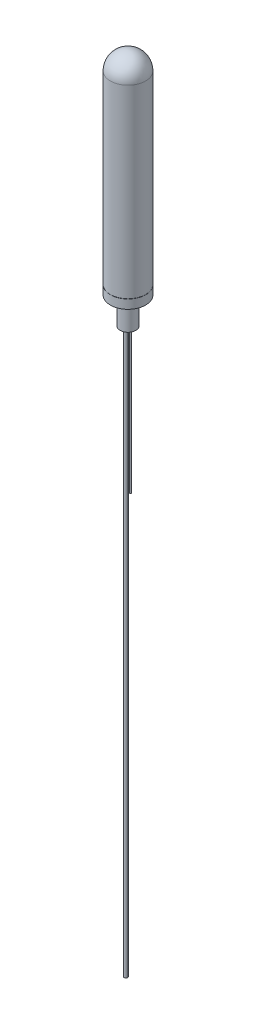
ISO-10303-21;
HEADER;
FILE_DESCRIPTION(('STEP AP214'),'2;1');
FILE_NAME('part.step','',(''),(''),'','','');
FILE_SCHEMA(('AUTOMOTIVE_DESIGN { 1 0 10303 214 1 1 1 1 }'));
ENDSEC;
DATA;
#1=APPLICATION_CONTEXT('core data for automotive mechanical design processes');
#2=APPLICATION_PROTOCOL_DEFINITION('international standard','automotive_design',2000,#1);
#3=PRODUCT_CONTEXT('',#1,'mechanical');
#4=PRODUCT('Part','Part','',(#3));
#5=PRODUCT_RELATED_PRODUCT_CATEGORY('part','',(#4));
#6=PRODUCT_DEFINITION_FORMATION('','',#4);
#7=PRODUCT_DEFINITION_CONTEXT('part definition',#1,'design');
#8=PRODUCT_DEFINITION('design','',#6,#7);
#9=PRODUCT_DEFINITION_SHAPE('','',#8);
#10=(LENGTH_UNIT() NAMED_UNIT(*) SI_UNIT(.MILLI.,.METRE.));
#11=(NAMED_UNIT(*) PLANE_ANGLE_UNIT() SI_UNIT($,.RADIAN.));
#12=(NAMED_UNIT(*) SI_UNIT($,.STERADIAN.) SOLID_ANGLE_UNIT());
#13=UNCERTAINTY_MEASURE_WITH_UNIT(LENGTH_MEASURE(1.E-05),#10,'distance_accuracy_value','');
#14=(GEOMETRIC_REPRESENTATION_CONTEXT(3) GLOBAL_UNCERTAINTY_ASSIGNED_CONTEXT((#13)) GLOBAL_UNIT_ASSIGNED_CONTEXT((#10,
#11,#12)) REPRESENTATION_CONTEXT('',''));
#15=CARTESIAN_POINT('',(0.,0.,0.));
#16=DIRECTION('',(0.,0.,1.));
#17=DIRECTION('',(1.,0.,0.));
#18=AXIS2_PLACEMENT_3D('',#15,#16,#17);
#19=CARTESIAN_POINT('',(1.778,-120.6,0.));
#20=DIRECTION('',(0.,1.,0.));
#21=DIRECTION('',(0.,0.,1.));
#22=AXIS2_PLACEMENT_3D('',#19,#20,#21);
#23=CYLINDRICAL_SURFACE('',#22,0.5969);
#24=CARTESIAN_POINT('',(1.778,-120.6,0.));
#25=DIRECTION('',(0.,-1.,0.));
#26=DIRECTION('',(0.,0.,-1.));
#27=AXIS2_PLACEMENT_3D('',#24,#25,#26);
#28=CIRCLE('',#27,0.5969);
#29=CARTESIAN_POINT('',(1.778,-120.6,-0.5969));
#30=VERTEX_POINT('',#29);
#31=EDGE_CURVE('E11',#30,#30,#28,.T.);
#32=ORIENTED_EDGE('',*,*,#31,.F.);
#33=EDGE_LOOP('',(#32));
#34=FACE_BOUND('',#33,.T.);
#35=CARTESIAN_POINT('',(1.778,-19.,0.));
#36=DIRECTION('',(0.,-1.,0.));
#37=DIRECTION('',(0.,0.,-1.));
#38=AXIS2_PLACEMENT_3D('',#35,#36,#37);
#39=CIRCLE('',#38,0.5969);
#40=CARTESIAN_POINT('',(1.778,-19.,-0.5969));
#41=VERTEX_POINT('',#40);
#42=EDGE_CURVE('E52',#41,#41,#39,.T.);
#43=ORIENTED_EDGE('',*,*,#42,.T.);
#44=EDGE_LOOP('',(#43));
#45=FACE_BOUND('',#44,.T.);
#46=ADVANCED_FACE('F49',(#34,#45),#23,.T.);
#47=CARTESIAN_POINT('',(1.778,-120.6,0.));
#48=DIRECTION('',(0.,-1.,0.));
#49=DIRECTION('',(0.,0.,-1.));
#50=AXIS2_PLACEMENT_3D('',#47,#48,#49);
#51=PLANE('',#50);
#52=ORIENTED_EDGE('',*,*,#31,.T.);
#53=EDGE_LOOP('',(#52));
#54=FACE_BOUND('',#53,.T.);
#55=ADVANCED_FACE('F66',(#54),#51,.T.);
#56=CARTESIAN_POINT('',(1.778,-19.,0.));
#57=DIRECTION('',(0.,-1.,0.));
#58=DIRECTION('',(0.,0.,-1.));
#59=AXIS2_PLACEMENT_3D('',#56,#57,#58);
#60=PLANE('',#59);
#61=ORIENTED_EDGE('',*,*,#42,.F.);
#62=EDGE_LOOP('',(#61));
#63=FACE_BOUND('',#62,.T.);
#64=ADVANCED_FACE('F64',(#63),#60,.F.);
#65=CLOSED_SHELL('',(#46,#55,#64));
#66=MANIFOLD_SOLID_BREP('B2',#65);
#67=CARTESIAN_POINT('',(-1.524,-419.,0.));
#68=DIRECTION('',(0.,1.,0.));
#69=DIRECTION('',(0.,0.,1.));
#70=AXIS2_PLACEMENT_3D('',#67,#68,#69);
#71=CYLINDRICAL_SURFACE('',#70,1.2446);
#72=CARTESIAN_POINT('',(-1.524,-419.,0.));
#73=DIRECTION('',(0.,-1.,0.));
#74=DIRECTION('',(0.,0.,-1.));
#75=AXIS2_PLACEMENT_3D('',#72,#73,#74);
#76=CIRCLE('',#75,1.2446);
#77=CARTESIAN_POINT('',(-1.524,-419.,-1.2446));
#78=VERTEX_POINT('',#77);
#79=EDGE_CURVE('E48',#78,#78,#76,.T.);
#80=ORIENTED_EDGE('',*,*,#79,.F.);
#81=EDGE_LOOP('',(#80));
#82=FACE_BOUND('',#81,.T.);
#83=CARTESIAN_POINT('',(-1.524,-19.,0.));
#84=DIRECTION('',(0.,-1.,0.));
#85=DIRECTION('',(0.,0.,-1.));
#86=AXIS2_PLACEMENT_3D('',#83,#84,#85);
#87=CIRCLE('',#86,1.2446);
#88=CARTESIAN_POINT('',(-1.524,-19.,-1.2446));
#89=VERTEX_POINT('',#88);
#90=EDGE_CURVE('E102',#89,#89,#87,.T.);
#91=ORIENTED_EDGE('',*,*,#90,.T.);
#92=EDGE_LOOP('',(#91));
#93=FACE_BOUND('',#92,.T.);
#94=ADVANCED_FACE('F99',(#82,#93),#71,.T.);
#95=CARTESIAN_POINT('',(-1.524,-419.,0.));
#96=DIRECTION('',(0.,-1.,0.));
#97=DIRECTION('',(0.,0.,-1.));
#98=AXIS2_PLACEMENT_3D('',#95,#96,#97);
#99=PLANE('',#98);
#100=ORIENTED_EDGE('',*,*,#79,.T.);
#101=EDGE_LOOP('',(#100));
#102=FACE_BOUND('',#101,.T.);
#103=ADVANCED_FACE('F115',(#102),#99,.T.);
#104=CARTESIAN_POINT('',(-1.524,-19.,0.));
#105=DIRECTION('',(0.,-1.,0.));
#106=DIRECTION('',(0.,0.,-1.));
#107=AXIS2_PLACEMENT_3D('',#104,#105,#106);
#108=PLANE('',#107);
#109=ORIENTED_EDGE('',*,*,#90,.F.);
#110=EDGE_LOOP('',(#109));
#111=FACE_BOUND('',#110,.T.);
#112=ADVANCED_FACE('F113',(#111),#108,.F.);
#113=CLOSED_SHELL('',(#94,#103,#112));
#114=MANIFOLD_SOLID_BREP('B6',#113);
#115=CARTESIAN_POINT('',(-3.01625,0.,0.));
#116=DIRECTION('',(0.,1.,0.));
#117=DIRECTION('',(0.,0.,1.));
#118=AXIS2_PLACEMENT_3D('',#115,#116,#117);
#119=PLANE('',#118);
#120=CARTESIAN_POINT('',(0.,0.,0.));
#121=DIRECTION('',(0.,-1.,0.));
#122=DIRECTION('',(0.,0.,-1.));
#123=AXIS2_PLACEMENT_3D('',#120,#121,#122);
#124=CIRCLE('',#123,3.01625);
#125=CARTESIAN_POINT('',(0.,0.,-3.01625));
#126=VERTEX_POINT('',#125);
#127=EDGE_CURVE('E98',#126,#126,#124,.T.);
#128=ORIENTED_EDGE('',*,*,#127,.T.);
#129=EDGE_LOOP('',(#128));
#130=FACE_BOUND('',#129,.T.);
#131=ADVANCED_FACE('F142',(#130),#119,.F.);
#132=CARTESIAN_POINT('',(0.,0.,0.));
#133=DIRECTION('',(0.,-1.,0.));
#134=DIRECTION('',(0.,0.,-1.));
#135=AXIS2_PLACEMENT_3D('',#132,#133,#134);
#136=CYLINDRICAL_SURFACE('',#135,3.01625);
#137=ORIENTED_EDGE('',*,*,#127,.F.);
#138=EDGE_LOOP('',(#137));
#139=FACE_BOUND('',#138,.T.);
#140=CARTESIAN_POINT('',(0.,-19.,0.));
#141=DIRECTION('',(0.,-1.,0.));
#142=DIRECTION('',(0.,0.,-1.));
#143=AXIS2_PLACEMENT_3D('',#140,#141,#142);
#144=CIRCLE('',#143,3.01625);
#145=CARTESIAN_POINT('',(0.,-19.,-3.01625));
#146=VERTEX_POINT('',#145);
#147=EDGE_CURVE('E149',#146,#146,#144,.T.);
#148=ORIENTED_EDGE('',*,*,#147,.T.);
#149=EDGE_LOOP('',(#148));
#150=FACE_BOUND('',#149,.T.);
#151=ADVANCED_FACE('F202',(#139,#150),#136,.F.);
#152=CARTESIAN_POINT('',(-3.01625,-19.,0.));
#153=DIRECTION('',(0.,1.,0.));
#154=DIRECTION('',(0.,0.,1.));
#155=AXIS2_PLACEMENT_3D('',#152,#153,#154);
#156=PLANE('',#155);
#157=ORIENTED_EDGE('',*,*,#147,.F.);
#158=EDGE_LOOP('',(#157));
#159=FACE_BOUND('',#158,.T.);
#160=CARTESIAN_POINT('',(0.,-19.,0.));
#161=DIRECTION('',(0.,-1.,0.));
#162=DIRECTION('',(0.,0.,-1.));
#163=AXIS2_PLACEMENT_3D('',#160,#161,#162);
#164=CIRCLE('',#163,5.55625);
#165=CARTESIAN_POINT('',(0.,-19.,-5.55625));
#166=VERTEX_POINT('',#165);
#167=EDGE_CURVE('E156',#166,#166,#164,.T.);
#168=ORIENTED_EDGE('',*,*,#167,.T.);
#169=EDGE_LOOP('',(#168));
#170=FACE_BOUND('',#169,.T.);
#171=ADVANCED_FACE('F206',(#159,#170),#156,.F.);
#172=CARTESIAN_POINT('',(0.,0.,0.));
#173=DIRECTION('',(0.,-1.,0.));
#174=DIRECTION('',(0.,0.,-1.));
#175=AXIS2_PLACEMENT_3D('',#172,#173,#174);
#176=CYLINDRICAL_SURFACE('',#175,5.55625);
#177=ORIENTED_EDGE('',*,*,#167,.F.);
#178=EDGE_LOOP('',(#177));
#179=FACE_BOUND('',#178,.T.);
#180=CARTESIAN_POINT('',(0.,0.,0.));
#181=DIRECTION('',(0.,-1.,0.));
#182=DIRECTION('',(0.,0.,-1.));
#183=AXIS2_PLACEMENT_3D('',#180,#181,#182);
#184=CIRCLE('',#183,5.55625);
#185=CARTESIAN_POINT('',(0.,0.,-5.55625));
#186=VERTEX_POINT('',#185);
#187=EDGE_CURVE('E161',#186,#186,#184,.T.);
#188=ORIENTED_EDGE('',*,*,#187,.T.);
#189=EDGE_LOOP('',(#188));
#190=FACE_BOUND('',#189,.T.);
#191=ADVANCED_FACE('F211',(#179,#190),#176,.T.);
#192=CARTESIAN_POINT('',(-5.55625,0.,0.));
#193=DIRECTION('',(0.,1.,0.));
#194=DIRECTION('',(0.,0.,1.));
#195=AXIS2_PLACEMENT_3D('',#192,#193,#194);
#196=PLANE('',#195);
#197=ORIENTED_EDGE('',*,*,#187,.F.);
#198=EDGE_LOOP('',(#197));
#199=FACE_BOUND('',#198,.T.);
#200=CARTESIAN_POINT('',(0.,0.,0.));
#201=DIRECTION('',(0.,-1.,0.));
#202=DIRECTION('',(0.,0.,-1.));
#203=AXIS2_PLACEMENT_3D('',#200,#201,#202);
#204=CIRCLE('',#203,12.5);
#205=CARTESIAN_POINT('',(0.,0.,-12.5));
#206=VERTEX_POINT('',#205);
#207=EDGE_CURVE('E166',#206,#206,#204,.T.);
#208=ORIENTED_EDGE('',*,*,#207,.T.);
#209=EDGE_LOOP('',(#208));
#210=FACE_BOUND('',#209,.T.);
#211=ADVANCED_FACE('F217',(#199,#210),#196,.F.);
#212=CARTESIAN_POINT('',(0.,0.,0.));
#213=DIRECTION('',(0.,-1.,0.));
#214=DIRECTION('',(0.,0.,-1.));
#215=AXIS2_PLACEMENT_3D('',#212,#213,#214);
#216=CYLINDRICAL_SURFACE('',#215,12.5);
#217=ORIENTED_EDGE('',*,*,#207,.F.);
#218=EDGE_LOOP('',(#217));
#219=FACE_BOUND('',#218,.T.);
#220=CARTESIAN_POINT('',(0.,6.35,0.));
#221=DIRECTION('',(0.,-1.,0.));
#222=DIRECTION('',(0.,0.,-1.));
#223=AXIS2_PLACEMENT_3D('',#220,#221,#222);
#224=CIRCLE('',#223,12.5);
#225=CARTESIAN_POINT('',(0.,6.35,-12.5));
#226=VERTEX_POINT('',#225);
#227=EDGE_CURVE('E170',#226,#226,#224,.T.);
#228=ORIENTED_EDGE('',*,*,#227,.T.);
#229=EDGE_LOOP('',(#228));
#230=FACE_BOUND('',#229,.T.);
#231=ADVANCED_FACE('F221',(#219,#230),#216,.T.);
#232=CARTESIAN_POINT('',(-12.5,6.35,0.));
#233=DIRECTION('',(0.,-1.,0.));
#234=DIRECTION('',(0.,0.,-1.));
#235=AXIS2_PLACEMENT_3D('',#232,#233,#234);
#236=PLANE('',#235);
#237=ORIENTED_EDGE('',*,*,#227,.F.);
#238=EDGE_LOOP('',(#237));
#239=FACE_BOUND('',#238,.T.);
#240=CARTESIAN_POINT('',(0.,6.35,0.));
#241=DIRECTION('',(0.,-1.,0.));
#242=DIRECTION('',(0.,0.,-1.));
#243=AXIS2_PLACEMENT_3D('',#240,#241,#242);
#244=CIRCLE('',#243,12.246);
#245=CARTESIAN_POINT('',(0.,6.35,-12.246));
#246=VERTEX_POINT('',#245);
#247=EDGE_CURVE('E174',#246,#246,#244,.T.);
#248=ORIENTED_EDGE('',*,*,#247,.T.);
#249=EDGE_LOOP('',(#248));
#250=FACE_BOUND('',#249,.T.);
#251=ADVANCED_FACE('F225',(#239,#250),#236,.F.);
#252=CARTESIAN_POINT('',(0.,0.,0.));
#253=DIRECTION('',(0.,-1.,0.));
#254=DIRECTION('',(0.,0.,-1.));
#255=AXIS2_PLACEMENT_3D('',#252,#253,#254);
#256=CYLINDRICAL_SURFACE('',#255,12.246);
#257=ORIENTED_EDGE('',*,*,#247,.F.);
#258=EDGE_LOOP('',(#257));
#259=FACE_BOUND('',#258,.T.);
#260=CARTESIAN_POINT('',(0.,6.477,0.));
#261=DIRECTION('',(0.,-1.,0.));
#262=DIRECTION('',(0.,0.,-1.));
#263=AXIS2_PLACEMENT_3D('',#260,#261,#262);
#264=CIRCLE('',#263,12.246);
#265=CARTESIAN_POINT('',(0.,6.477,-12.246));
#266=VERTEX_POINT('',#265);
#267=EDGE_CURVE('E178',#266,#266,#264,.T.);
#268=ORIENTED_EDGE('',*,*,#267,.T.);
#269=EDGE_LOOP('',(#268));
#270=FACE_BOUND('',#269,.T.);
#271=ADVANCED_FACE('F229',(#259,#270),#256,.T.);
#272=CARTESIAN_POINT('',(-12.246,6.477,0.));
#273=DIRECTION('',(0.,1.,0.));
#274=DIRECTION('',(0.,0.,1.));
#275=AXIS2_PLACEMENT_3D('',#272,#273,#274);
#276=PLANE('',#275);
#277=ORIENTED_EDGE('',*,*,#267,.F.);
#278=EDGE_LOOP('',(#277));
#279=FACE_BOUND('',#278,.T.);
#280=CARTESIAN_POINT('',(0.,6.477,0.));
#281=DIRECTION('',(0.,-1.,0.));
#282=DIRECTION('',(0.,0.,-1.));
#283=AXIS2_PLACEMENT_3D('',#280,#281,#282);
#284=CIRCLE('',#283,12.5);
#285=CARTESIAN_POINT('',(0.,6.477,-12.5));
#286=VERTEX_POINT('',#285);
#287=EDGE_CURVE('E182',#286,#286,#284,.T.);
#288=ORIENTED_EDGE('',*,*,#287,.T.);
#289=EDGE_LOOP('',(#288));
#290=FACE_BOUND('',#289,.T.);
#291=ADVANCED_FACE('F198',(#279,#290),#276,.F.);
#292=CARTESIAN_POINT('',(0.,0.,0.));
#293=DIRECTION('',(0.,-1.,0.));
#294=DIRECTION('',(0.,0.,-1.));
#295=AXIS2_PLACEMENT_3D('',#292,#293,#294);
#296=CYLINDRICAL_SURFACE('',#295,12.5);
#297=ORIENTED_EDGE('',*,*,#287,.F.);
#298=EDGE_LOOP('',(#297));
#299=FACE_BOUND('',#298,.T.);
#300=CARTESIAN_POINT('',(0.,137.5,0.));
#301=DIRECTION('',(0.,-1.,0.));
#302=DIRECTION('',(0.,0.,-1.));
#303=AXIS2_PLACEMENT_3D('',#300,#301,#302);
#304=CIRCLE('',#303,12.5);
#305=CARTESIAN_POINT('',(0.,137.5,-12.5));
#306=VERTEX_POINT('',#305);
#307=EDGE_CURVE('E186',#306,#306,#304,.T.);
#308=ORIENTED_EDGE('',*,*,#307,.T.);
#309=EDGE_LOOP('',(#308));
#310=FACE_BOUND('',#309,.T.);
#311=ADVANCED_FACE('F190',(#299,#310),#296,.T.);
#312=CARTESIAN_POINT('',(0.,137.5,0.));
#313=DIRECTION('',(0.,-1.,0.));
#314=DIRECTION('',(-1.,0.,0.));
#315=AXIS2_PLACEMENT_3D('',#312,#313,#314);
#316=SPHERICAL_SURFACE('',#315,12.5);
#317=ORIENTED_EDGE('',*,*,#307,.F.);
#318=EDGE_LOOP('',(#317));
#319=FACE_BOUND('',#318,.T.);
#320=ADVANCED_FACE('F192',(#319),#316,.T.);
#321=CLOSED_SHELL('',(#131,#151,#171,#191,#211,#231,#251,#271,#291,#311,#320));
#322=MANIFOLD_SOLID_BREP('B43',#321);
#323=ADVANCED_BREP_SHAPE_REPRESENTATION('',(#18,#66,#114,#322),#14);
#324=SHAPE_DEFINITION_REPRESENTATION(#9,#323);
ENDSEC;
END-ISO-10303-21;
